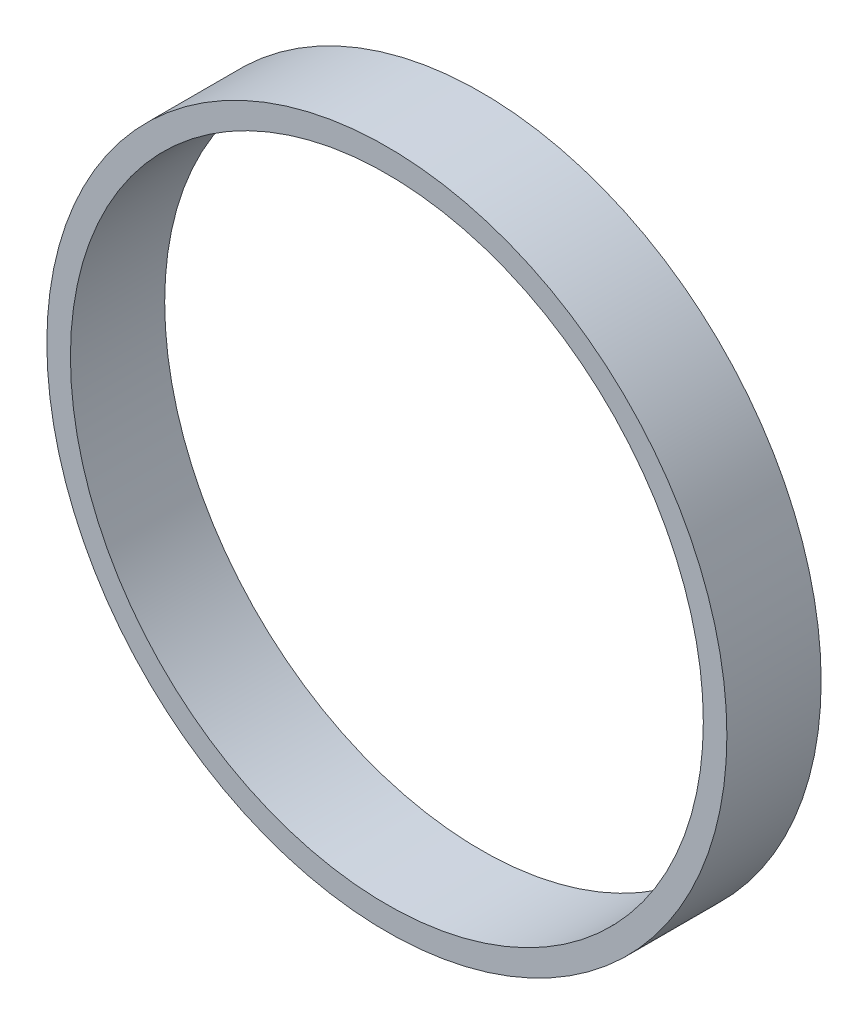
from build123d import *

# Parameters (mm, degrees)
SKETCH1_R           = 25.25
SKETCH1_R_2         = 23.5
BOSS_EXTRUDE1_DEPTH = 3.5


with BuildPart() as part:
    # Sketch1 → Boss-Extrude1 (new, symmetric)
    with BuildSketch(Plane.XY):
        Circle(SKETCH1_R)
        Circle(SKETCH1_R_2, mode=Mode.SUBTRACT)
    extrude(amount=BOSS_EXTRUDE1_DEPTH, both=True)


solid = part.part
